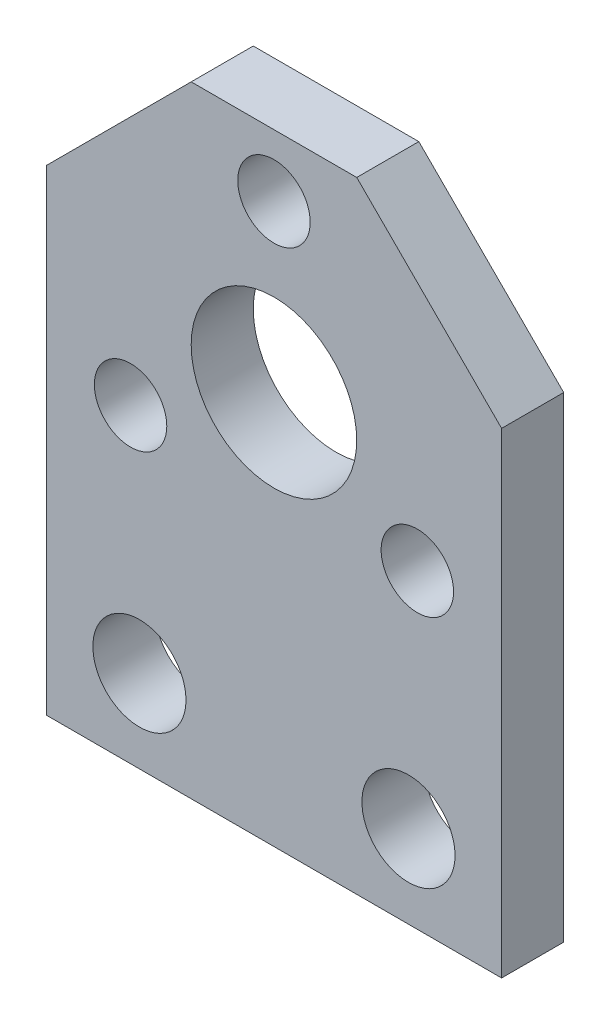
ISO-10303-21;
HEADER;
FILE_DESCRIPTION(('STEP AP214'),'2;1');
FILE_NAME('part.step','',(''),(''),'','','');
FILE_SCHEMA(('AUTOMOTIVE_DESIGN { 1 0 10303 214 1 1 1 1 }'));
ENDSEC;
DATA;
#1=APPLICATION_CONTEXT('core data for automotive mechanical design processes');
#2=APPLICATION_PROTOCOL_DEFINITION('international standard','automotive_design',2000,#1);
#3=PRODUCT_CONTEXT('',#1,'mechanical');
#4=PRODUCT('Part','Part','',(#3));
#5=PRODUCT_RELATED_PRODUCT_CATEGORY('part','',(#4));
#6=PRODUCT_DEFINITION_FORMATION('','',#4);
#7=PRODUCT_DEFINITION_CONTEXT('part definition',#1,'design');
#8=PRODUCT_DEFINITION('design','',#6,#7);
#9=PRODUCT_DEFINITION_SHAPE('','',#8);
#10=(LENGTH_UNIT() NAMED_UNIT(*) SI_UNIT(.MILLI.,.METRE.));
#11=(NAMED_UNIT(*) PLANE_ANGLE_UNIT() SI_UNIT($,.RADIAN.));
#12=(NAMED_UNIT(*) SI_UNIT($,.STERADIAN.) SOLID_ANGLE_UNIT());
#13=UNCERTAINTY_MEASURE_WITH_UNIT(LENGTH_MEASURE(1.E-05),#10,'distance_accuracy_value','');
#14=(GEOMETRIC_REPRESENTATION_CONTEXT(3) GLOBAL_UNCERTAINTY_ASSIGNED_CONTEXT((#13)) GLOBAL_UNIT_ASSIGNED_CONTEXT((#10,
#11,#12)) REPRESENTATION_CONTEXT('',''));
#15=CARTESIAN_POINT('',(0.,0.,0.));
#16=DIRECTION('',(0.,0.,1.));
#17=DIRECTION('',(1.,0.,0.));
#18=AXIS2_PLACEMENT_3D('',#15,#16,#17);
#19=CARTESIAN_POINT('',(-11.,-19.,3.));
#20=DIRECTION('',(0.,0.,1.));
#21=DIRECTION('',(1.,0.,0.));
#22=AXIS2_PLACEMENT_3D('',#19,#20,#21);
#23=PLANE('',#22);
#24=CARTESIAN_POINT('',(-6.92820323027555,-3.99999999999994,3.));
#25=DIRECTION('',(0.,0.,1.));
#26=DIRECTION('',(1.,0.,0.));
#27=AXIS2_PLACEMENT_3D('',#24,#25,#26);
#28=CIRCLE('',#27,1.75);
#29=CARTESIAN_POINT('',(-5.17820323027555,-3.99999999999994,3.));
#30=VERTEX_POINT('',#29);
#31=EDGE_CURVE('E168',#30,#30,#28,.T.);
#32=ORIENTED_EDGE('',*,*,#31,.F.);
#33=EDGE_LOOP('',(#32));
#34=FACE_BOUND('',#33,.T.);
#35=CARTESIAN_POINT('',(-6.5,-15.,3.));
#36=DIRECTION('',(0.,0.,1.));
#37=DIRECTION('',(1.,0.,0.));
#38=AXIS2_PLACEMENT_3D('',#35,#36,#37);
#39=CIRCLE('',#38,2.25);
#40=CARTESIAN_POINT('',(-4.25,-15.,3.));
#41=VERTEX_POINT('',#40);
#42=EDGE_CURVE('E156',#41,#41,#39,.T.);
#43=ORIENTED_EDGE('',*,*,#42,.F.);
#44=EDGE_LOOP('',(#43));
#45=FACE_BOUND('',#44,.T.);
#46=CARTESIAN_POINT('',(0.,0.,3.));
#47=DIRECTION('',(0.,0.,1.));
#48=DIRECTION('',(1.,0.,0.));
#49=AXIS2_PLACEMENT_3D('',#46,#47,#48);
#50=CIRCLE('',#49,4.);
#51=CARTESIAN_POINT('',(4.,0.,3.));
#52=VERTEX_POINT('',#51);
#53=EDGE_CURVE('E144',#52,#52,#50,.T.);
#54=ORIENTED_EDGE('',*,*,#53,.F.);
#55=EDGE_LOOP('',(#54));
#56=FACE_BOUND('',#55,.T.);
#57=DIRECTION('',(0.,1.,0.));
#58=VECTOR('',#57,1.);
#59=CARTESIAN_POINT('',(11.,11.,3.));
#60=LINE('',#59,#58);
#61=CARTESIAN_POINT('',(11.,-19.,3.));
#62=VERTEX_POINT('',#61);
#63=CARTESIAN_POINT('',(11.,3.99999999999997,3.));
#64=VERTEX_POINT('',#63);
#65=EDGE_CURVE('E102',#62,#64,#60,.T.);
#66=ORIENTED_EDGE('',*,*,#65,.T.);
#67=DIRECTION('',(0.707106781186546,-0.707106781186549,0.));
#68=VECTOR('',#67,1.);
#69=CARTESIAN_POINT('',(11.5,3.49999999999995,3.));
#70=LINE('',#69,#68);
#71=CARTESIAN_POINT('',(4.,11.,3.));
#72=VERTEX_POINT('',#71);
#73=EDGE_CURVE('E41',#64,#72,#70,.F.);
#74=ORIENTED_EDGE('',*,*,#73,.T.);
#75=DIRECTION('',(-1.,0.,0.));
#76=VECTOR('',#75,1.);
#77=CARTESIAN_POINT('',(-11.,11.,3.));
#78=LINE('',#77,#76);
#79=CARTESIAN_POINT('',(-3.99999999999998,11.,3.));
#80=VERTEX_POINT('',#79);
#81=EDGE_CURVE('E112',#72,#80,#78,.T.);
#82=ORIENTED_EDGE('',*,*,#81,.T.);
#83=DIRECTION('',(0.707106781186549,0.707106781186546,0.));
#84=VECTOR('',#83,1.);
#85=CARTESIAN_POINT('',(-22.5,-7.49999999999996,3.));
#86=LINE('',#85,#84);
#87=CARTESIAN_POINT('',(-11.,4.00000000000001,3.));
#88=VERTEX_POINT('',#87);
#89=EDGE_CURVE('E48',#80,#88,#86,.F.);
#90=ORIENTED_EDGE('',*,*,#89,.T.);
#91=DIRECTION('',(0.,-1.,0.));
#92=VECTOR('',#91,1.);
#93=CARTESIAN_POINT('',(-11.,11.,3.));
#94=LINE('',#93,#92);
#95=CARTESIAN_POINT('',(-11.,-19.,3.));
#96=VERTEX_POINT('',#95);
#97=EDGE_CURVE('E86',#88,#96,#94,.T.);
#98=ORIENTED_EDGE('',*,*,#97,.T.);
#99=DIRECTION('',(1.,0.,0.));
#100=VECTOR('',#99,1.);
#101=CARTESIAN_POINT('',(-11.,-19.,3.));
#102=LINE('',#101,#100);
#103=EDGE_CURVE('E89',#96,#62,#102,.T.);
#104=ORIENTED_EDGE('',*,*,#103,.T.);
#105=EDGE_LOOP('',(#66,#74,#82,#90,#98,#104));
#106=FACE_BOUND('',#105,.T.);
#107=CARTESIAN_POINT('',(0.,8.,3.));
#108=DIRECTION('',(0.,0.,1.));
#109=DIRECTION('',(1.,0.,0.));
#110=AXIS2_PLACEMENT_3D('',#107,#108,#109);
#111=CIRCLE('',#110,1.75);
#112=CARTESIAN_POINT('',(1.75,8.,3.));
#113=VERTEX_POINT('',#112);
#114=EDGE_CURVE('E150',#113,#113,#111,.T.);
#115=ORIENTED_EDGE('',*,*,#114,.F.);
#116=EDGE_LOOP('',(#115));
#117=FACE_BOUND('',#116,.T.);
#118=CARTESIAN_POINT('',(6.92820323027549,-4.00000000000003,3.));
#119=DIRECTION('',(0.,0.,1.));
#120=DIRECTION('',(1.,0.,0.));
#121=AXIS2_PLACEMENT_3D('',#118,#119,#120);
#122=CIRCLE('',#121,1.75);
#123=CARTESIAN_POINT('',(8.67820323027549,-4.00000000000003,3.));
#124=VERTEX_POINT('',#123);
#125=EDGE_CURVE('E162',#124,#124,#122,.T.);
#126=ORIENTED_EDGE('',*,*,#125,.F.);
#127=EDGE_LOOP('',(#126));
#128=FACE_BOUND('',#127,.T.);
#129=CARTESIAN_POINT('',(6.5,-15.,3.));
#130=DIRECTION('',(0.,0.,1.));
#131=DIRECTION('',(1.,0.,0.));
#132=AXIS2_PLACEMENT_3D('',#129,#130,#131);
#133=CIRCLE('',#132,2.25);
#134=CARTESIAN_POINT('',(8.75,-15.,3.));
#135=VERTEX_POINT('',#134);
#136=EDGE_CURVE('E174',#135,#135,#133,.T.);
#137=ORIENTED_EDGE('',*,*,#136,.F.);
#138=EDGE_LOOP('',(#137));
#139=FACE_BOUND('',#138,.T.);
#140=ADVANCED_FACE('F33',(#34,#45,#56,#106,#117,#128,#139),#23,.T.);
#141=CARTESIAN_POINT('',(-11.,-19.,0.));
#142=DIRECTION('',(0.,0.,1.));
#143=DIRECTION('',(1.,0.,0.));
#144=AXIS2_PLACEMENT_3D('',#141,#142,#143);
#145=PLANE('',#144);
#146=CARTESIAN_POINT('',(-6.92820323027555,-3.99999999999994,0.));
#147=DIRECTION('',(0.,0.,1.));
#148=DIRECTION('',(1.,0.,0.));
#149=AXIS2_PLACEMENT_3D('',#146,#147,#148);
#150=CIRCLE('',#149,1.75);
#151=CARTESIAN_POINT('',(-5.17820323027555,-3.99999999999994,0.));
#152=VERTEX_POINT('',#151);
#153=EDGE_CURVE('E171',#152,#152,#150,.T.);
#154=ORIENTED_EDGE('',*,*,#153,.T.);
#155=EDGE_LOOP('',(#154));
#156=FACE_BOUND('',#155,.T.);
#157=CARTESIAN_POINT('',(-6.5,-15.,0.));
#158=DIRECTION('',(0.,0.,1.));
#159=DIRECTION('',(1.,0.,0.));
#160=AXIS2_PLACEMENT_3D('',#157,#158,#159);
#161=CIRCLE('',#160,2.25);
#162=CARTESIAN_POINT('',(-4.25,-15.,0.));
#163=VERTEX_POINT('',#162);
#164=EDGE_CURVE('E159',#163,#163,#161,.T.);
#165=ORIENTED_EDGE('',*,*,#164,.T.);
#166=EDGE_LOOP('',(#165));
#167=FACE_BOUND('',#166,.T.);
#168=CARTESIAN_POINT('',(0.,0.,0.));
#169=DIRECTION('',(0.,0.,1.));
#170=DIRECTION('',(1.,0.,0.));
#171=AXIS2_PLACEMENT_3D('',#168,#169,#170);
#172=CIRCLE('',#171,4.);
#173=CARTESIAN_POINT('',(4.,0.,0.));
#174=VERTEX_POINT('',#173);
#175=EDGE_CURVE('E147',#174,#174,#172,.T.);
#176=ORIENTED_EDGE('',*,*,#175,.T.);
#177=EDGE_LOOP('',(#176));
#178=FACE_BOUND('',#177,.T.);
#179=DIRECTION('',(-1.,0.,0.));
#180=VECTOR('',#179,1.);
#181=CARTESIAN_POINT('',(-11.,11.,0.));
#182=LINE('',#181,#180);
#183=CARTESIAN_POINT('',(4.,11.,0.));
#184=VERTEX_POINT('',#183);
#185=CARTESIAN_POINT('',(-3.99999999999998,11.,0.));
#186=VERTEX_POINT('',#185);
#187=EDGE_CURVE('E94',#184,#186,#182,.T.);
#188=ORIENTED_EDGE('',*,*,#187,.F.);
#189=DIRECTION('',(-0.707106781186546,0.707106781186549,0.));
#190=VECTOR('',#189,1.);
#191=CARTESIAN_POINT('',(3.99999999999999,11.,0.));
#192=LINE('',#191,#190);
#193=CARTESIAN_POINT('',(11.,3.99999999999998,0.));
#194=VERTEX_POINT('',#193);
#195=EDGE_CURVE('E120',#184,#194,#192,.F.);
#196=ORIENTED_EDGE('',*,*,#195,.T.);
#197=DIRECTION('',(0.,1.,0.));
#198=VECTOR('',#197,1.);
#199=CARTESIAN_POINT('',(11.,11.,0.));
#200=LINE('',#199,#198);
#201=CARTESIAN_POINT('',(11.,-19.,0.));
#202=VERTEX_POINT('',#201);
#203=EDGE_CURVE('E138',#202,#194,#200,.T.);
#204=ORIENTED_EDGE('',*,*,#203,.F.);
#205=DIRECTION('',(1.,0.,0.));
#206=VECTOR('',#205,1.);
#207=CARTESIAN_POINT('',(-11.,-19.,0.));
#208=LINE('',#207,#206);
#209=CARTESIAN_POINT('',(-11.,-19.,0.));
#210=VERTEX_POINT('',#209);
#211=EDGE_CURVE('E140',#210,#202,#208,.T.);
#212=ORIENTED_EDGE('',*,*,#211,.F.);
#213=DIRECTION('',(0.,-1.,0.));
#214=VECTOR('',#213,1.);
#215=CARTESIAN_POINT('',(-11.,11.,0.));
#216=LINE('',#215,#214);
#217=CARTESIAN_POINT('',(-11.,4.00000000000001,0.));
#218=VERTEX_POINT('',#217);
#219=EDGE_CURVE('E106',#218,#210,#216,.T.);
#220=ORIENTED_EDGE('',*,*,#219,.F.);
#221=DIRECTION('',(-0.707106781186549,-0.707106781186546,0.));
#222=VECTOR('',#221,1.);
#223=CARTESIAN_POINT('',(-11.,4.,0.));
#224=LINE('',#223,#222);
#225=EDGE_CURVE('E118',#218,#186,#224,.F.);
#226=ORIENTED_EDGE('',*,*,#225,.T.);
#227=EDGE_LOOP('',(#188,#196,#204,#212,#220,#226));
#228=FACE_BOUND('',#227,.T.);
#229=CARTESIAN_POINT('',(0.,8.,0.));
#230=DIRECTION('',(0.,0.,1.));
#231=DIRECTION('',(1.,0.,0.));
#232=AXIS2_PLACEMENT_3D('',#229,#230,#231);
#233=CIRCLE('',#232,1.75);
#234=CARTESIAN_POINT('',(1.75,8.,0.));
#235=VERTEX_POINT('',#234);
#236=EDGE_CURVE('E153',#235,#235,#233,.T.);
#237=ORIENTED_EDGE('',*,*,#236,.T.);
#238=EDGE_LOOP('',(#237));
#239=FACE_BOUND('',#238,.T.);
#240=CARTESIAN_POINT('',(6.92820323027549,-4.00000000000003,0.));
#241=DIRECTION('',(0.,0.,1.));
#242=DIRECTION('',(1.,0.,0.));
#243=AXIS2_PLACEMENT_3D('',#240,#241,#242);
#244=CIRCLE('',#243,1.75);
#245=CARTESIAN_POINT('',(8.67820323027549,-4.00000000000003,0.));
#246=VERTEX_POINT('',#245);
#247=EDGE_CURVE('E165',#246,#246,#244,.T.);
#248=ORIENTED_EDGE('',*,*,#247,.T.);
#249=EDGE_LOOP('',(#248));
#250=FACE_BOUND('',#249,.T.);
#251=CARTESIAN_POINT('',(6.5,-15.,0.));
#252=DIRECTION('',(0.,0.,1.));
#253=DIRECTION('',(1.,0.,0.));
#254=AXIS2_PLACEMENT_3D('',#251,#252,#253);
#255=CIRCLE('',#254,2.25);
#256=CARTESIAN_POINT('',(8.75,-15.,0.));
#257=VERTEX_POINT('',#256);
#258=EDGE_CURVE('E177',#257,#257,#255,.T.);
#259=ORIENTED_EDGE('',*,*,#258,.T.);
#260=EDGE_LOOP('',(#259));
#261=FACE_BOUND('',#260,.T.);
#262=ADVANCED_FACE('F136',(#156,#167,#178,#228,#239,#250,#261),#145,.F.);
#263=CARTESIAN_POINT('',(-11.,11.,3.));
#264=DIRECTION('',(1.,0.,0.));
#265=DIRECTION('',(0.,1.,0.));
#266=AXIS2_PLACEMENT_3D('',#263,#264,#265);
#267=PLANE('',#266);
#268=ORIENTED_EDGE('',*,*,#97,.F.);
#269=DIRECTION('',(0.,0.,-1.));
#270=VECTOR('',#269,1.);
#271=CARTESIAN_POINT('',(-11.,4.,3.));
#272=LINE('',#271,#270);
#273=EDGE_CURVE('E11',#88,#218,#272,.T.);
#274=ORIENTED_EDGE('',*,*,#273,.T.);
#275=ORIENTED_EDGE('',*,*,#219,.T.);
#276=DIRECTION('',(0.,0.,-1.));
#277=VECTOR('',#276,1.);
#278=CARTESIAN_POINT('',(-11.,-19.,3.));
#279=LINE('',#278,#277);
#280=EDGE_CURVE('E99',#96,#210,#279,.T.);
#281=ORIENTED_EDGE('',*,*,#280,.F.);
#282=EDGE_LOOP('',(#268,#274,#275,#281));
#283=FACE_BOUND('',#282,.T.);
#284=ADVANCED_FACE('F104',(#283),#267,.F.);
#285=CARTESIAN_POINT('',(-11.,-19.,3.));
#286=DIRECTION('',(0.,1.,0.));
#287=DIRECTION('',(0.,0.,1.));
#288=AXIS2_PLACEMENT_3D('',#285,#286,#287);
#289=PLANE('',#288);
#290=ORIENTED_EDGE('',*,*,#211,.T.);
#291=DIRECTION('',(0.,0.,-1.));
#292=VECTOR('',#291,1.);
#293=CARTESIAN_POINT('',(11.,-19.,3.));
#294=LINE('',#293,#292);
#295=EDGE_CURVE('E101',#62,#202,#294,.T.);
#296=ORIENTED_EDGE('',*,*,#295,.F.);
#297=ORIENTED_EDGE('',*,*,#103,.F.);
#298=ORIENTED_EDGE('',*,*,#280,.T.);
#299=EDGE_LOOP('',(#290,#296,#297,#298));
#300=FACE_BOUND('',#299,.T.);
#301=ADVANCED_FACE('F98',(#300),#289,.F.);
#302=CARTESIAN_POINT('',(11.,11.,3.));
#303=DIRECTION('',(-1.,0.,0.));
#304=DIRECTION('',(0.,-1.,0.));
#305=AXIS2_PLACEMENT_3D('',#302,#303,#304);
#306=PLANE('',#305);
#307=ORIENTED_EDGE('',*,*,#203,.T.);
#308=DIRECTION('',(0.,0.,1.));
#309=VECTOR('',#308,1.);
#310=CARTESIAN_POINT('',(11.,3.99999999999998,3.));
#311=LINE('',#310,#309);
#312=EDGE_CURVE('E56',#194,#64,#311,.T.);
#313=ORIENTED_EDGE('',*,*,#312,.T.);
#314=ORIENTED_EDGE('',*,*,#65,.F.);
#315=ORIENTED_EDGE('',*,*,#295,.T.);
#316=EDGE_LOOP('',(#307,#313,#314,#315));
#317=FACE_BOUND('',#316,.T.);
#318=ADVANCED_FACE('F139',(#317),#306,.F.);
#319=CARTESIAN_POINT('',(-11.,11.,3.));
#320=DIRECTION('',(0.,-1.,0.));
#321=DIRECTION('',(0.,0.,-1.));
#322=AXIS2_PLACEMENT_3D('',#319,#320,#321);
#323=PLANE('',#322);
#324=ORIENTED_EDGE('',*,*,#81,.F.);
#325=DIRECTION('',(0.,0.,-1.));
#326=VECTOR('',#325,1.);
#327=CARTESIAN_POINT('',(3.99999999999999,11.,3.));
#328=LINE('',#327,#326);
#329=EDGE_CURVE('E110',#72,#184,#328,.T.);
#330=ORIENTED_EDGE('',*,*,#329,.T.);
#331=ORIENTED_EDGE('',*,*,#187,.T.);
#332=DIRECTION('',(0.,0.,1.));
#333=VECTOR('',#332,1.);
#334=CARTESIAN_POINT('',(-3.99999999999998,11.,3.));
#335=LINE('',#334,#333);
#336=EDGE_CURVE('E108',#186,#80,#335,.T.);
#337=ORIENTED_EDGE('',*,*,#336,.T.);
#338=EDGE_LOOP('',(#324,#330,#331,#337));
#339=FACE_BOUND('',#338,.T.);
#340=ADVANCED_FACE('F128',(#339),#323,.F.);
#341=CARTESIAN_POINT('',(0.,0.,3.));
#342=DIRECTION('',(0.,0.,-1.));
#343=DIRECTION('',(-1.,0.,0.));
#344=AXIS2_PLACEMENT_3D('',#341,#342,#343);
#345=CYLINDRICAL_SURFACE('',#344,4.);
#346=ORIENTED_EDGE('',*,*,#53,.T.);
#347=EDGE_LOOP('',(#346));
#348=FACE_BOUND('',#347,.T.);
#349=ORIENTED_EDGE('',*,*,#175,.F.);
#350=EDGE_LOOP('',(#349));
#351=FACE_BOUND('',#350,.T.);
#352=ADVANCED_FACE('F197',(#348,#351),#345,.F.);
#353=CARTESIAN_POINT('',(0.,8.,3.));
#354=DIRECTION('',(0.,0.,-1.));
#355=DIRECTION('',(-1.,0.,0.));
#356=AXIS2_PLACEMENT_3D('',#353,#354,#355);
#357=CYLINDRICAL_SURFACE('',#356,1.75);
#358=ORIENTED_EDGE('',*,*,#114,.T.);
#359=EDGE_LOOP('',(#358));
#360=FACE_BOUND('',#359,.T.);
#361=ORIENTED_EDGE('',*,*,#236,.F.);
#362=EDGE_LOOP('',(#361));
#363=FACE_BOUND('',#362,.T.);
#364=ADVANCED_FACE('F227',(#360,#363),#357,.F.);
#365=CARTESIAN_POINT('',(-6.5,-15.,3.));
#366=DIRECTION('',(0.,0.,-1.));
#367=DIRECTION('',(-1.,0.,0.));
#368=AXIS2_PLACEMENT_3D('',#365,#366,#367);
#369=CYLINDRICAL_SURFACE('',#368,2.25);
#370=ORIENTED_EDGE('',*,*,#42,.T.);
#371=EDGE_LOOP('',(#370));
#372=FACE_BOUND('',#371,.T.);
#373=ORIENTED_EDGE('',*,*,#164,.F.);
#374=EDGE_LOOP('',(#373));
#375=FACE_BOUND('',#374,.T.);
#376=ADVANCED_FACE('F224',(#372,#375),#369,.F.);
#377=CARTESIAN_POINT('',(6.92820323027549,-4.00000000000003,3.));
#378=DIRECTION('',(0.,0.,-1.));
#379=DIRECTION('',(-1.,0.,0.));
#380=AXIS2_PLACEMENT_3D('',#377,#378,#379);
#381=CYLINDRICAL_SURFACE('',#380,1.75);
#382=ORIENTED_EDGE('',*,*,#125,.T.);
#383=EDGE_LOOP('',(#382));
#384=FACE_BOUND('',#383,.T.);
#385=ORIENTED_EDGE('',*,*,#247,.F.);
#386=EDGE_LOOP('',(#385));
#387=FACE_BOUND('',#386,.T.);
#388=ADVANCED_FACE('F218',(#384,#387),#381,.F.);
#389=CARTESIAN_POINT('',(-6.92820323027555,-3.99999999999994,3.));
#390=DIRECTION('',(0.,0.,-1.));
#391=DIRECTION('',(-1.,0.,0.));
#392=AXIS2_PLACEMENT_3D('',#389,#390,#391);
#393=CYLINDRICAL_SURFACE('',#392,1.75);
#394=ORIENTED_EDGE('',*,*,#31,.T.);
#395=EDGE_LOOP('',(#394));
#396=FACE_BOUND('',#395,.T.);
#397=ORIENTED_EDGE('',*,*,#153,.F.);
#398=EDGE_LOOP('',(#397));
#399=FACE_BOUND('',#398,.T.);
#400=ADVANCED_FACE('F213',(#396,#399),#393,.F.);
#401=CARTESIAN_POINT('',(6.5,-15.,3.));
#402=DIRECTION('',(0.,0.,-1.));
#403=DIRECTION('',(-1.,0.,0.));
#404=AXIS2_PLACEMENT_3D('',#401,#402,#403);
#405=CYLINDRICAL_SURFACE('',#404,2.25);
#406=ORIENTED_EDGE('',*,*,#136,.T.);
#407=EDGE_LOOP('',(#406));
#408=FACE_BOUND('',#407,.T.);
#409=ORIENTED_EDGE('',*,*,#258,.F.);
#410=EDGE_LOOP('',(#409));
#411=FACE_BOUND('',#410,.T.);
#412=ADVANCED_FACE('F183',(#408,#411),#405,.F.);
#413=CARTESIAN_POINT('',(3.99999999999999,11.,3.));
#414=DIRECTION('',(-0.707106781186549,-0.707106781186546,0.));
#415=DIRECTION('',(0.707106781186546,-0.707106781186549,0.));
#416=AXIS2_PLACEMENT_3D('',#413,#414,#415);
#417=PLANE('',#416);
#418=ORIENTED_EDGE('',*,*,#73,.F.);
#419=ORIENTED_EDGE('',*,*,#312,.F.);
#420=ORIENTED_EDGE('',*,*,#195,.F.);
#421=ORIENTED_EDGE('',*,*,#329,.F.);
#422=EDGE_LOOP('',(#418,#419,#420,#421));
#423=FACE_BOUND('',#422,.T.);
#424=ADVANCED_FACE('F133',(#423),#417,.F.);
#425=CARTESIAN_POINT('',(-11.,4.,3.));
#426=DIRECTION('',(0.707106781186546,-0.707106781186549,0.));
#427=DIRECTION('',(0.707106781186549,0.707106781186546,0.));
#428=AXIS2_PLACEMENT_3D('',#425,#426,#427);
#429=PLANE('',#428);
#430=ORIENTED_EDGE('',*,*,#89,.F.);
#431=ORIENTED_EDGE('',*,*,#336,.F.);
#432=ORIENTED_EDGE('',*,*,#225,.F.);
#433=ORIENTED_EDGE('',*,*,#273,.F.);
#434=EDGE_LOOP('',(#430,#431,#432,#433));
#435=FACE_BOUND('',#434,.T.);
#436=ADVANCED_FACE('F35',(#435),#429,.F.);
#437=CLOSED_SHELL('',(#140,#262,#284,#301,#318,#340,#352,#364,#376,#388,#400,#412,#424,#436));
#438=MANIFOLD_SOLID_BREP('B2',#437);
#439=ADVANCED_BREP_SHAPE_REPRESENTATION('',(#18,#438),#14);
#440=SHAPE_DEFINITION_REPRESENTATION(#9,#439);
ENDSEC;
END-ISO-10303-21;
